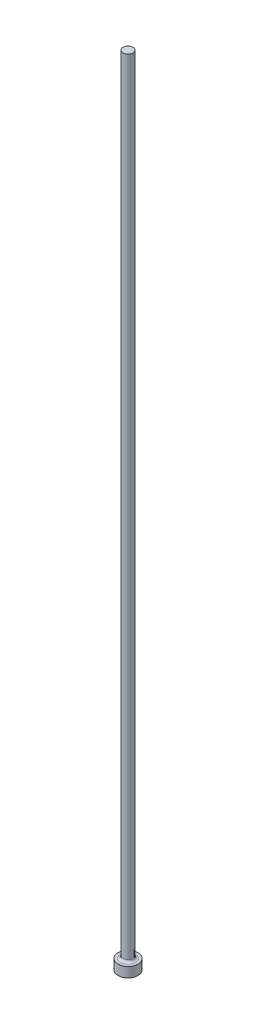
from build123d import *


with BuildPart() as part:
    # Sketch1 → Revolve1 (revolve)
    with BuildSketch(Plane.XY, mode=Mode.PRIVATE) as revolve1_sk:
        with BuildLine():
            Line((0, 0), (3.175, 0))
            Line((3.175, 0), (3.175, 3.175))
            Line((3.175, 3.175), (2.3495, 3.175))
            ThreePointArc((2.3495, 3.175), (1.810684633, 3.398184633), (1.5875, 3.937))
            Line((1.5875, 3.937), (1.5875, 254))
            Line((1.5875, 254), (0, 254))
            Line((0, 254), (0, 0))
        make_face()
    revolve(revolve1_sk.sketch.rotate(Axis((0, 254, 0), (0, -1, 0)), 180), axis=Axis((0, 254, 0), (0, -1, 0)))


solid = part.part
